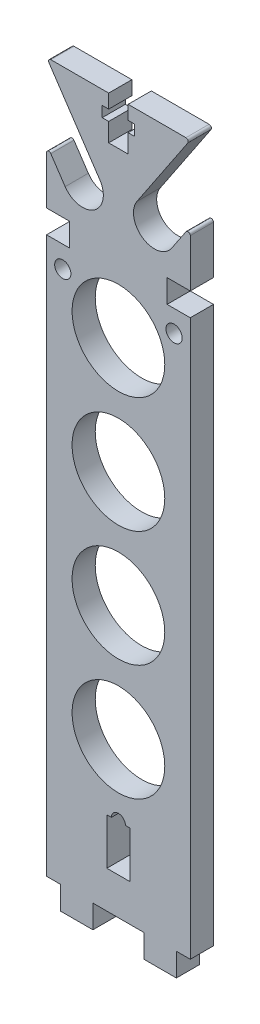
from build123d import *

# Parameters (mm, degrees)
BOSS_EXTRU_1_DEPTH       = 5
ENL_V_MAT_EXTRU_5_DEPTH  = 10
ENL_V_MAT_EXTRU_6_DEPTH  = 10
ESQUISSE9_W              = 31
ESQUISSE9_H              = 17
ENL_V_MAT_EXTRU_7_DEPTH  = 10
ESQUISSE10_R             = 10
ENL_V_MAT_EXTRU_8_DEPTH  = 10
CONG_2_R                 = 0.5
CONG_3_R                 = 0.5
ESQUISSE11_W             = 5
ESQUISSE11_H             = 5
ENL_V_MAT_EXTRU_9_DEPTH  = 30
ENL_V_MAT_EXTRU_10_DEPTH = 5
ESQUISSE13_R             = 1.75
ENL_V_MAT_EXTRU_11_DEPTH = 10


with BuildPart() as part:
    # Esquisse1 → Boss.-Extru.1 (new body)
    with BuildSketch(Plane.XY):
        Polygon((-15.5, 0), (-12.5, 0), (-12.5, -5), (-5.5, -5), (-5.5, 0), (5.5, 0), (5.5, -5), (12.5, -5), (12.5, 0), (15.5, 0), (15.5, 170), (-15.5, 170), align=None)
    extrude(amount=BOSS_EXTRU_1_DEPTH)

    # Esquisse6 → Enl_v. mat.-Extru.5 (cut)
    with BuildSketch(Plane(origin=(0, 0, 0), x_dir=(-1, 0, 0), z_dir=(0, 0, -1))):
        with BuildLine():
            Line((1.509374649, 18), (2.5, 18))
            Line((2.5, 18), (2.5, 8))
            Line((2.5, 8), (-2.5, 8))
            Line((-2.5, 8), (-2.5, 18))
            Line((-2.5, 18), (-1.509374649, 18))
            ThreePointArc((-1.509374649, 18), (0, 19.509374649), (1.509374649, 18))
        make_face()
    extrude(amount=-ENL_V_MAT_EXTRU_5_DEPTH, mode=Mode.SUBTRACT)

    # Esquisse7 → Enl_v. mat.-Extru.6 (cut)
    with BuildSketch(Plane(origin=(0, 0, 0), x_dir=(-1, 0, 0), z_dir=(0, 0, -1))):
        with BuildLine():
            Line((-4.010302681, 135.832931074), (-15.5, 153))
            Line((-15.5, 153), (-15.5, 136.818971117))
            Line((-15.5, 136.818971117), (-11.489697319, 130.827068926))
            ThreePointArc((-11.489697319, 130.827068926), (-5.247068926, 129.590302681), (-4.010302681, 135.832931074))
        make_face()
    enl_v_mat_extru_6 = extrude(amount=-ENL_V_MAT_EXTRU_6_DEPTH, mode=Mode.SUBTRACT)

    # Sym_trie1: Enl_v. mat.-Extru.6 across plane
    add(enl_v_mat_extru_6.mirror(Plane(origin=(0, 0, 0), x_dir=(0, 0, 1), z_dir=(1, 0, 0))), mode=Mode.SUBTRACT)

    # Esquisse9 → Enl_v. mat.-Extru.7 (cut)
    with BuildSketch(Plane(origin=(0, 0, 0), x_dir=(-1, 0, 0), z_dir=(0, 0, -1))):
        with Locations((0, 161.5)):
            Rectangle(ESQUISSE9_W, ESQUISSE9_H)
    extrude(amount=-ENL_V_MAT_EXTRU_7_DEPTH, mode=Mode.SUBTRACT)

    # Esquisse10 → Enl_v. mat.-Extru.8 (cut)
    with BuildSketch(Plane(origin=(0, 0, 0), x_dir=(-1, 0, 0), z_dir=(0, 0, -1))):
        with Locations((0, 108.33)):
            Circle(ESQUISSE10_R)
        with Locations((0, 83.33)):
            Circle(ESQUISSE10_R)
        with Locations((0, 58.33)):
            Circle(ESQUISSE10_R)
        with Locations((0, 33.33)):
            Circle(ESQUISSE10_R)
    extrude(amount=-ENL_V_MAT_EXTRU_8_DEPTH, mode=Mode.SUBTRACT)

    # Cong_2
    cong_2_edges = [part.edges().sort_by_distance(p)[0] for p in [
        (15.5, 153, 2.5),
        (-15.5, 153, 2.5),
    ]]
    fillet(cong_2_edges, radius=CONG_2_R)

    # Cong_3
    cong_3_edges = [part.edges().sort_by_distance(p)[0] for p in [
        (15.5, 136.818971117, 2.5),
        (-15.5, 136.818971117, 2.5),
    ]]
    fillet(cong_3_edges, radius=CONG_3_R)

    # Esquisse11 → Enl_v. mat.-Extru.9 (cut)
    with BuildSketch(Plane(origin=(0, 0, 0), x_dir=(-1, 0, 0), z_dir=(0, 0, -1))):
        with Locations((-13, 122.33)):
            Rectangle(ESQUISSE11_W, ESQUISSE11_H)
    enl_v_mat_extru_9 = extrude(amount=-ENL_V_MAT_EXTRU_9_DEPTH, mode=Mode.SUBTRACT)

    # Sym_trie2: Enl_v. mat.-Extru.9 across plane
    add(enl_v_mat_extru_9.mirror(Plane(origin=(0, 0, 0), x_dir=(0, 0, 1), z_dir=(1, 0, 0))), mode=Mode.SUBTRACT)

    # Esquisse12 → Enl_v. mat.-Extru.10 (cut)
    with BuildSketch(Plane.XY.offset(5)):
        Polygon((-3.5, 150), (-2.1, 150), (-2.1, 153), (2.1, 153), (2.1, 150), (3.5, 150), (3.5, 147.7), (2.1, 147.7), (2.1, 143.7), (-2.1, 143.7), (-2.1, 147.7), (-3.5, 147.7), align=None)
    extrude(amount=-ENL_V_MAT_EXTRU_10_DEPTH, mode=Mode.SUBTRACT)

    # Esquisse13 → Enl_v. mat.-Extru.11 (cut)
    with BuildSketch(Plane.XY.offset(5)):
        with Locations((-12, 115.151084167)):
            Circle(ESQUISSE13_R)
    enl_v_mat_extru_11 = extrude(amount=-ENL_V_MAT_EXTRU_11_DEPTH, mode=Mode.SUBTRACT)

    # Sym_trie3: Enl_v. mat.-Extru.11 across plane
    add(enl_v_mat_extru_11.mirror(Plane(origin=(0, 0, 0), x_dir=(0, 0, 1), z_dir=(1, 0, 0))), mode=Mode.SUBTRACT)


solid = part.part
